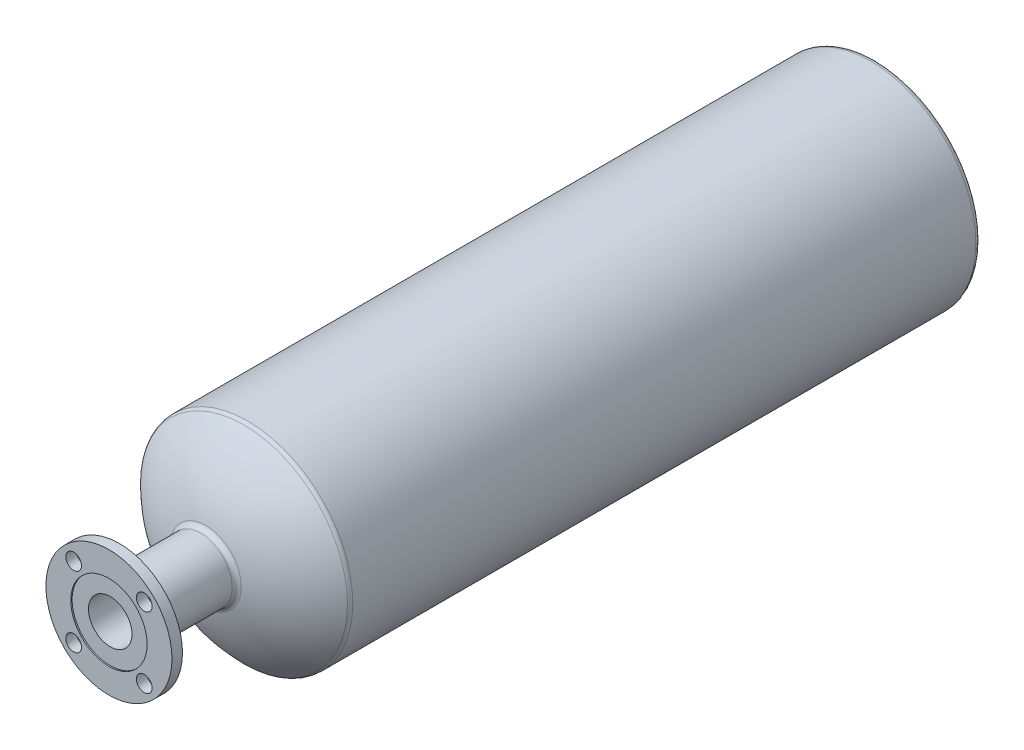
ISO-10303-21;
HEADER;
FILE_DESCRIPTION(('STEP AP214'),'2;1');
FILE_NAME('part.step','',(''),(''),'','','');
FILE_SCHEMA(('AUTOMOTIVE_DESIGN { 1 0 10303 214 1 1 1 1 }'));
ENDSEC;
DATA;
#1=APPLICATION_CONTEXT('core data for automotive mechanical design processes');
#2=APPLICATION_PROTOCOL_DEFINITION('international standard','automotive_design',2000,#1);
#3=PRODUCT_CONTEXT('',#1,'mechanical');
#4=PRODUCT('Part','Part','',(#3));
#5=PRODUCT_RELATED_PRODUCT_CATEGORY('part','',(#4));
#6=PRODUCT_DEFINITION_FORMATION('','',#4);
#7=PRODUCT_DEFINITION_CONTEXT('part definition',#1,'design');
#8=PRODUCT_DEFINITION('design','',#6,#7);
#9=PRODUCT_DEFINITION_SHAPE('','',#8);
#10=(LENGTH_UNIT() NAMED_UNIT(*) SI_UNIT(.MILLI.,.METRE.));
#11=(NAMED_UNIT(*) PLANE_ANGLE_UNIT() SI_UNIT($,.RADIAN.));
#12=(NAMED_UNIT(*) SI_UNIT($,.STERADIAN.) SOLID_ANGLE_UNIT());
#13=UNCERTAINTY_MEASURE_WITH_UNIT(LENGTH_MEASURE(1.E-05),#10,'distance_accuracy_value','');
#14=(GEOMETRIC_REPRESENTATION_CONTEXT(3) GLOBAL_UNCERTAINTY_ASSIGNED_CONTEXT((#13)) GLOBAL_UNIT_ASSIGNED_CONTEXT((#10,
#11,#12)) REPRESENTATION_CONTEXT('',''));
#15=CARTESIAN_POINT('',(0.,0.,0.));
#16=DIRECTION('',(0.,0.,1.));
#17=DIRECTION('',(1.,0.,0.));
#18=AXIS2_PLACEMENT_3D('',#15,#16,#17);
#19=CARTESIAN_POINT('',(0.,0.,-152.4));
#20=DIRECTION('',(0.,0.,1.));
#21=DIRECTION('',(1.,0.,0.));
#22=AXIS2_PLACEMENT_3D('',#19,#20,#21);
#23=CYLINDRICAL_SURFACE('',#22,38.1);
#24=CARTESIAN_POINT('',(0.,0.,-98.1292384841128));
#25=DIRECTION('',(0.,0.,-1.));
#26=DIRECTION('',(-1.,0.,0.));
#27=AXIS2_PLACEMENT_3D('',#24,#25,#26);
#28=CIRCLE('',#27,38.1);
#29=CARTESIAN_POINT('',(38.1,0.,-98.1292384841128));
#30=VERTEX_POINT('',#29);
#31=EDGE_CURVE('E40',#30,#30,#28,.F.);
#32=CARTESIAN_POINT('',(0.,0.,-6.34999999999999));
#33=DIRECTION('',(0.,0.,1.));
#34=DIRECTION('',(1.,0.,0.));
#35=AXIS2_PLACEMENT_3D('',#32,#33,#34);
#36=CIRCLE('',#35,38.1);
#37=CARTESIAN_POINT('',(38.1,0.,-6.35000000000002));
#38=VERTEX_POINT('',#37);
#39=EDGE_CURVE('E44',#38,#38,#36,.F.);
#40=CARTESIAN_POINT('',(38.1,0.,-98.1292384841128));
#41=CARTESIAN_POINT('',(38.1,0.,-97.1732047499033));
#42=CARTESIAN_POINT('',(38.1,0.,-96.2171710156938));
#43=CARTESIAN_POINT('',(38.1,0.,-94.3051035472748));
#44=CARTESIAN_POINT('',(38.1,0.,-93.3490698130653));
#45=CARTESIAN_POINT('',(38.1,0.,-91.4370023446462));
#46=CARTESIAN_POINT('',(38.1,0.,-90.4809686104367));
#47=CARTESIAN_POINT('',(38.1,0.,-88.5689011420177));
#48=CARTESIAN_POINT('',(38.1,0.,-87.6128674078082));
#49=CARTESIAN_POINT('',(38.1,0.,-85.7007999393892));
#50=CARTESIAN_POINT('',(38.1,0.,-84.7447662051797));
#51=CARTESIAN_POINT('',(38.1,0.,-82.8326987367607));
#52=CARTESIAN_POINT('',(38.1,0.,-81.8766650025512));
#53=CARTESIAN_POINT('',(38.1,0.,-79.9645975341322));
#54=CARTESIAN_POINT('',(38.1,0.,-79.0085637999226));
#55=CARTESIAN_POINT('',(38.1,0.,-77.0964963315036));
#56=CARTESIAN_POINT('',(38.1,0.,-76.1404625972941));
#57=CARTESIAN_POINT('',(38.1,0.,-74.2283951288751));
#58=CARTESIAN_POINT('',(38.1,0.,-73.2723613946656));
#59=CARTESIAN_POINT('',(38.1,0.,-71.3602939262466));
#60=CARTESIAN_POINT('',(38.1,0.,-70.4042601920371));
#61=CARTESIAN_POINT('',(38.1,0.,-68.4921927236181));
#62=CARTESIAN_POINT('',(38.1,0.,-67.5361589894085));
#63=CARTESIAN_POINT('',(38.1,0.,-65.6240915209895));
#64=CARTESIAN_POINT('',(38.1,0.,-64.66805778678));
#65=CARTESIAN_POINT('',(38.1,0.,-62.755990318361));
#66=CARTESIAN_POINT('',(38.1,0.,-61.7999565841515));
#67=CARTESIAN_POINT('',(38.1,0.,-59.8878891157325));
#68=CARTESIAN_POINT('',(38.1,0.,-58.931855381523));
#69=CARTESIAN_POINT('',(38.1,0.,-57.019787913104));
#70=CARTESIAN_POINT('',(38.1,0.,-56.0637541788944));
#71=CARTESIAN_POINT('',(38.1,0.,-54.1516867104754));
#72=CARTESIAN_POINT('',(38.1,0.,-53.1956529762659));
#73=CARTESIAN_POINT('',(38.1,0.,-51.2835855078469));
#74=CARTESIAN_POINT('',(38.1,0.,-50.3275517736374));
#75=CARTESIAN_POINT('',(38.1,0.,-48.4154843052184));
#76=CARTESIAN_POINT('',(38.1,0.,-47.4594505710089));
#77=CARTESIAN_POINT('',(38.1,0.,-45.5473831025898));
#78=CARTESIAN_POINT('',(38.1,0.,-44.5913493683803));
#79=CARTESIAN_POINT('',(38.1,0.,-42.6792818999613));
#80=CARTESIAN_POINT('',(38.1,0.,-41.7232481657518));
#81=CARTESIAN_POINT('',(38.1,0.,-39.8111806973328));
#82=CARTESIAN_POINT('',(38.1,0.,-38.8551469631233));
#83=CARTESIAN_POINT('',(38.1,0.,-36.9430794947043));
#84=CARTESIAN_POINT('',(38.1,0.,-35.9870457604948));
#85=CARTESIAN_POINT('',(38.1,0.,-34.0749782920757));
#86=CARTESIAN_POINT('',(38.1,0.,-33.1189445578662));
#87=CARTESIAN_POINT('',(38.1,0.,-31.2068770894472));
#88=CARTESIAN_POINT('',(38.1,0.,-30.2508433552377));
#89=CARTESIAN_POINT('',(38.1,0.,-28.3387758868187));
#90=CARTESIAN_POINT('',(38.1,0.,-27.3827421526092));
#91=CARTESIAN_POINT('',(38.1,0.,-25.4706746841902));
#92=CARTESIAN_POINT('',(38.1,0.,-24.5146409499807));
#93=CARTESIAN_POINT('',(38.1,0.,-22.6025734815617));
#94=CARTESIAN_POINT('',(38.1,0.,-21.6465397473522));
#95=CARTESIAN_POINT('',(38.1,0.,-19.7344722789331));
#96=CARTESIAN_POINT('',(38.1,0.,-18.7784385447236));
#97=CARTESIAN_POINT('',(38.1,0.,-16.8663710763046));
#98=CARTESIAN_POINT('',(38.1,0.,-15.9103373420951));
#99=CARTESIAN_POINT('',(38.1,0.,-13.9982698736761));
#100=CARTESIAN_POINT('',(38.1,0.,-13.0422361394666));
#101=CARTESIAN_POINT('',(38.1,0.,-11.1301686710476));
#102=CARTESIAN_POINT('',(38.1,0.,-10.1741349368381));
#103=CARTESIAN_POINT('',(38.1,0.,-8.26206746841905));
#104=CARTESIAN_POINT('',(38.1,0.,-7.30603373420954));
#105=CARTESIAN_POINT('',(38.1,0.,-6.35000000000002));
#106=B_SPLINE_CURVE_WITH_KNOTS('',3,(#40,#41,#42,#43,#44,#45,#46,#47,#48,#49,#50,#51,#52,#53,
#54,#55,#56,#57,#58,#59,#60,#61,#62,#63,#64,#65,#66,#67,#68,#69,#70,#71,#72,#73,#74,#75,#76,#77,
#78,#79,#80,#81,#82,#83,#84,#85,#86,#87,#88,#89,#90,#91,#92,#93,#94,#95,#96,#97,#98,#99,#100,
#101,#102,#103,#104,#105),.UNSPECIFIED.,.F.,.F.,(4,2,2,2,2,2,2,2,2,2,2,2,2,2,2,2,2,2,2,2,2,2,2,
2,2,2,2,2,2,2,2,2,4),(0.,2.86810120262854,5.73620240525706,8.60430360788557,11.4724048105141,
14.3405060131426,17.2086072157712,20.0767084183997,22.9448096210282,25.8129108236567,
28.6810120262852,31.5491132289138,34.4172144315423,37.2853156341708,40.1534168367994,
43.0215180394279,45.8896192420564,48.7577204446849,51.6258216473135,54.493922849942,
57.3620240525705,60.230125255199,63.0982264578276,65.9663276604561,68.8344288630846,
71.7025300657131,74.5706312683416,77.4387324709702,80.3068336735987,83.1749348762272,
86.0430360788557,88.9111372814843,91.7792384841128),.UNSPECIFIED.);
#107=EDGE_CURVE('BSEAM32',#30,#38,#106,.T.);
#108=ORIENTED_EDGE('',*,*,#31,.T.);
#109=ORIENTED_EDGE('',*,*,#39,.T.);
#110=ORIENTED_EDGE('',*,*,#107,.T.);
#111=ORIENTED_EDGE('',*,*,#107,.F.);
#112=EDGE_LOOP('',(#108,#110,#109,#111));
#113=FACE_BOUND('',#112,.T.);
#114=ADVANCED_FACE('F32',(#113),#23,.T.);
#115=CARTESIAN_POINT('',(0.,0.,0.));
#116=DIRECTION('',(0.,0.,1.));
#117=DIRECTION('',(1.,0.,0.));
#118=AXIS2_PLACEMENT_3D('',#115,#116,#117);
#119=PLANE('',#118);
#120=CARTESIAN_POINT('',(0.,0.,0.));
#121=DIRECTION('',(0.,0.,1.));
#122=DIRECTION('',(1.,0.,0.));
#123=AXIS2_PLACEMENT_3D('',#120,#121,#122);
#124=CIRCLE('',#123,44.45);
#125=CARTESIAN_POINT('',(44.45,0.,0.));
#126=VERTEX_POINT('',#125);
#127=EDGE_CURVE('E10',#126,#126,#124,.T.);
#128=ORIENTED_EDGE('',*,*,#127,.T.);
#129=EDGE_LOOP('',(#128));
#130=FACE_BOUND('',#129,.T.);
#131=CARTESIAN_POINT('',(-42.6562165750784,42.6562165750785,0.));
#132=DIRECTION('',(0.,0.,1.));
#133=DIRECTION('',(0.,1.,0.));
#134=AXIS2_PLACEMENT_3D('',#131,#132,#133);
#135=CIRCLE('',#134,9.525);
#136=CARTESIAN_POINT('',(-42.6562165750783,52.1812165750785,0.));
#137=VERTEX_POINT('',#136);
#138=EDGE_CURVE('E88',#137,#137,#135,.T.);
#139=ORIENTED_EDGE('',*,*,#138,.T.);
#140=EDGE_LOOP('',(#139));
#141=FACE_BOUND('',#140,.T.);
#142=CARTESIAN_POINT('',(42.6562165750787,-42.6562165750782,0.));
#143=DIRECTION('',(0.,0.,1.));
#144=DIRECTION('',(0.,-1.,0.));
#145=AXIS2_PLACEMENT_3D('',#142,#143,#144);
#146=CIRCLE('',#145,9.525);
#147=CARTESIAN_POINT('',(42.6562165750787,-52.1812165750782,0.));
#148=VERTEX_POINT('',#147);
#149=EDGE_CURVE('E74',#148,#148,#146,.T.);
#150=ORIENTED_EDGE('',*,*,#149,.T.);
#151=EDGE_LOOP('',(#150));
#152=FACE_BOUND('',#151,.T.);
#153=CARTESIAN_POINT('',(0.,0.,0.));
#154=DIRECTION('',(0.,0.,1.));
#155=DIRECTION('',(1.,0.,0.));
#156=AXIS2_PLACEMENT_3D('',#153,#154,#155);
#157=CIRCLE('',#156,76.2);
#158=CARTESIAN_POINT('',(76.2,0.,0.));
#159=VERTEX_POINT('',#158);
#160=EDGE_CURVE('E65',#159,#159,#157,.T.);
#161=ORIENTED_EDGE('',*,*,#160,.F.);
#162=EDGE_LOOP('',(#161));
#163=FACE_BOUND('',#162,.T.);
#164=CARTESIAN_POINT('',(42.6562165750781,42.6562165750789,0.));
#165=DIRECTION('',(0.,0.,1.));
#166=DIRECTION('',(1.,0.,0.));
#167=AXIS2_PLACEMENT_3D('',#164,#165,#166);
#168=CIRCLE('',#167,9.525);
#169=CARTESIAN_POINT('',(52.1812165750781,42.6562165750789,0.));
#170=VERTEX_POINT('',#169);
#171=EDGE_CURVE('E71',#170,#170,#168,.T.);
#172=ORIENTED_EDGE('',*,*,#171,.T.);
#173=EDGE_LOOP('',(#172));
#174=FACE_BOUND('',#173,.T.);
#175=CARTESIAN_POINT('',(-42.6562165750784,-42.6562165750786,0.));
#176=DIRECTION('',(0.,0.,1.));
#177=DIRECTION('',(-1.,0.,0.));
#178=AXIS2_PLACEMENT_3D('',#175,#176,#177);
#179=CIRCLE('',#178,9.525);
#180=CARTESIAN_POINT('',(-52.1812165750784,-42.6562165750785,0.));
#181=VERTEX_POINT('',#180);
#182=EDGE_CURVE('E82',#181,#181,#179,.T.);
#183=ORIENTED_EDGE('',*,*,#182,.T.);
#184=EDGE_LOOP('',(#183));
#185=FACE_BOUND('',#184,.T.);
#186=ADVANCED_FACE('F123',(#130,#141,#152,#163,#174,#185),#119,.F.);
#187=CARTESIAN_POINT('',(0.,0.,12.7));
#188=DIRECTION('',(0.,0.,1.));
#189=DIRECTION('',(1.,0.,0.));
#190=AXIS2_PLACEMENT_3D('',#187,#188,#189);
#191=PLANE('',#190);
#192=CARTESIAN_POINT('',(0.,0.,12.7));
#193=DIRECTION('',(0.,0.,1.));
#194=DIRECTION('',(1.,0.,0.));
#195=AXIS2_PLACEMENT_3D('',#192,#193,#194);
#196=CIRCLE('',#195,46.101);
#197=CARTESIAN_POINT('',(46.101,0.,12.7));
#198=VERTEX_POINT('',#197);
#199=EDGE_CURVE('E97',#198,#198,#196,.T.);
#200=ORIENTED_EDGE('',*,*,#199,.F.);
#201=EDGE_LOOP('',(#200));
#202=FACE_BOUND('',#201,.T.);
#203=CARTESIAN_POINT('',(-42.6562165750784,-42.6562165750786,12.7));
#204=DIRECTION('',(0.,0.,1.));
#205=DIRECTION('',(-1.,0.,0.));
#206=AXIS2_PLACEMENT_3D('',#203,#204,#205);
#207=CIRCLE('',#206,9.525);
#208=CARTESIAN_POINT('',(-52.1812165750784,-42.6562165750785,12.7));
#209=VERTEX_POINT('',#208);
#210=EDGE_CURVE('E85',#209,#209,#207,.T.);
#211=ORIENTED_EDGE('',*,*,#210,.F.);
#212=EDGE_LOOP('',(#211));
#213=FACE_BOUND('',#212,.T.);
#214=CARTESIAN_POINT('',(42.6562165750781,42.6562165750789,12.7));
#215=DIRECTION('',(0.,0.,1.));
#216=DIRECTION('',(1.,0.,0.));
#217=AXIS2_PLACEMENT_3D('',#214,#215,#216);
#218=CIRCLE('',#217,9.525);
#219=CARTESIAN_POINT('',(52.1812165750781,42.6562165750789,12.7));
#220=VERTEX_POINT('',#219);
#221=EDGE_CURVE('E68',#220,#220,#218,.T.);
#222=ORIENTED_EDGE('',*,*,#221,.F.);
#223=EDGE_LOOP('',(#222));
#224=FACE_BOUND('',#223,.T.);
#225=CARTESIAN_POINT('',(0.,0.,12.7));
#226=DIRECTION('',(0.,0.,1.));
#227=DIRECTION('',(1.,0.,0.));
#228=AXIS2_PLACEMENT_3D('',#225,#226,#227);
#229=CIRCLE('',#228,76.2);
#230=CARTESIAN_POINT('',(76.2,0.,12.7));
#231=VERTEX_POINT('',#230);
#232=EDGE_CURVE('E64',#231,#231,#229,.T.);
#233=ORIENTED_EDGE('',*,*,#232,.T.);
#234=EDGE_LOOP('',(#233));
#235=FACE_BOUND('',#234,.T.);
#236=CARTESIAN_POINT('',(42.6562165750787,-42.6562165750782,12.7));
#237=DIRECTION('',(0.,0.,1.));
#238=DIRECTION('',(0.,-1.,0.));
#239=AXIS2_PLACEMENT_3D('',#236,#237,#238);
#240=CIRCLE('',#239,9.525);
#241=CARTESIAN_POINT('',(42.6562165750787,-52.1812165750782,12.7));
#242=VERTEX_POINT('',#241);
#243=EDGE_CURVE('E79',#242,#242,#240,.T.);
#244=ORIENTED_EDGE('',*,*,#243,.F.);
#245=EDGE_LOOP('',(#244));
#246=FACE_BOUND('',#245,.T.);
#247=CARTESIAN_POINT('',(-42.6562165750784,42.6562165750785,12.7));
#248=DIRECTION('',(0.,0.,1.));
#249=DIRECTION('',(0.,1.,0.));
#250=AXIS2_PLACEMENT_3D('',#247,#248,#249);
#251=CIRCLE('',#250,9.525);
#252=CARTESIAN_POINT('',(-42.6562165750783,52.1812165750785,12.7));
#253=VERTEX_POINT('',#252);
#254=EDGE_CURVE('E91',#253,#253,#251,.T.);
#255=ORIENTED_EDGE('',*,*,#254,.F.);
#256=EDGE_LOOP('',(#255));
#257=FACE_BOUND('',#256,.T.);
#258=ADVANCED_FACE('F129',(#202,#213,#224,#235,#246,#257),#191,.T.);
#259=CARTESIAN_POINT('',(0.,0.,12.7));
#260=DIRECTION('',(0.,0.,-1.));
#261=DIRECTION('',(-1.,0.,0.));
#262=AXIS2_PLACEMENT_3D('',#259,#260,#261);
#263=CYLINDRICAL_SURFACE('',#262,76.2);
#264=ORIENTED_EDGE('',*,*,#232,.F.);
#265=EDGE_LOOP('',(#264));
#266=FACE_BOUND('',#265,.T.);
#267=ORIENTED_EDGE('',*,*,#160,.T.);
#268=EDGE_LOOP('',(#267));
#269=FACE_BOUND('',#268,.T.);
#270=ADVANCED_FACE('F151',(#266,#269),#263,.T.);
#271=CARTESIAN_POINT('',(42.6562165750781,42.6562165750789,12.7));
#272=DIRECTION('',(0.,0.,-1.));
#273=DIRECTION('',(-1.,0.,0.));
#274=AXIS2_PLACEMENT_3D('',#271,#272,#273);
#275=CYLINDRICAL_SURFACE('',#274,9.525);
#276=ORIENTED_EDGE('',*,*,#221,.T.);
#277=EDGE_LOOP('',(#276));
#278=FACE_BOUND('',#277,.T.);
#279=ORIENTED_EDGE('',*,*,#171,.F.);
#280=EDGE_LOOP('',(#279));
#281=FACE_BOUND('',#280,.T.);
#282=ADVANCED_FACE('F147',(#278,#281),#275,.F.);
#283=CARTESIAN_POINT('',(42.6562165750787,-42.6562165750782,12.7));
#284=DIRECTION('',(0.,0.,-1.));
#285=DIRECTION('',(0.,1.,0.));
#286=AXIS2_PLACEMENT_3D('',#283,#284,#285);
#287=CYLINDRICAL_SURFACE('',#286,9.525);
#288=ORIENTED_EDGE('',*,*,#243,.T.);
#289=EDGE_LOOP('',(#288));
#290=FACE_BOUND('',#289,.T.);
#291=ORIENTED_EDGE('',*,*,#149,.F.);
#292=EDGE_LOOP('',(#291));
#293=FACE_BOUND('',#292,.T.);
#294=ADVANCED_FACE('F143',(#290,#293),#287,.F.);
#295=CARTESIAN_POINT('',(-42.6562165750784,-42.6562165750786,12.7));
#296=DIRECTION('',(0.,0.,-1.));
#297=DIRECTION('',(1.,0.,0.));
#298=AXIS2_PLACEMENT_3D('',#295,#296,#297);
#299=CYLINDRICAL_SURFACE('',#298,9.525);
#300=ORIENTED_EDGE('',*,*,#210,.T.);
#301=EDGE_LOOP('',(#300));
#302=FACE_BOUND('',#301,.T.);
#303=ORIENTED_EDGE('',*,*,#182,.F.);
#304=EDGE_LOOP('',(#303));
#305=FACE_BOUND('',#304,.T.);
#306=ADVANCED_FACE('F139',(#302,#305),#299,.F.);
#307=CARTESIAN_POINT('',(-42.6562165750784,42.6562165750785,12.7));
#308=DIRECTION('',(0.,0.,-1.));
#309=DIRECTION('',(0.,-1.,0.));
#310=AXIS2_PLACEMENT_3D('',#307,#308,#309);
#311=CYLINDRICAL_SURFACE('',#310,9.525);
#312=ORIENTED_EDGE('',*,*,#254,.T.);
#313=EDGE_LOOP('',(#312));
#314=FACE_BOUND('',#313,.T.);
#315=ORIENTED_EDGE('',*,*,#138,.F.);
#316=EDGE_LOOP('',(#315));
#317=FACE_BOUND('',#316,.T.);
#318=ADVANCED_FACE('F136',(#314,#317),#311,.F.);
#319=CARTESIAN_POINT('',(0.,0.,-276.834078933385));
#320=DIRECTION('',(0.,0.,1.));
#321=DIRECTION('',(0.,1.,0.));
#322=AXIS2_PLACEMENT_3D('',#319,#320,#321);
#323=SPHERICAL_SURFACE('',#322,177.8);
#324=CARTESIAN_POINT('',(0.,0.,-150.508324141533));
#325=DIRECTION('',(0.,0.,-1.));
#326=DIRECTION('',(-1.,0.,0.));
#327=AXIS2_PLACEMENT_3D('',#324,#325,#326);
#328=CIRCLE('',#327,125.118518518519);
#329=CARTESIAN_POINT('',(0.,125.118518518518,-150.508324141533));
#330=VERTEX_POINT('',#329);
#331=EDGE_CURVE('E49',#330,#330,#328,.F.);
#332=CARTESIAN_POINT('',(0.,0.,-104.291474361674));
#333=DIRECTION('',(0.,0.,-1.));
#334=DIRECTION('',(-1.,0.,0.));
#335=AXIS2_PLACEMENT_3D('',#332,#333,#334);
#336=CIRCLE('',#335,42.9172413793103);
#337=CARTESIAN_POINT('',(0.,42.9172413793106,-104.291474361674));
#338=VERTEX_POINT('',#337);
#339=EDGE_CURVE('E52',#338,#338,#336,.T.);
#340=CARTESIAN_POINT('',(0.,125.118518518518,-150.508324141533));
#341=CARTESIAN_POINT('',(0.,124.41213435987,-149.808689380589));
#342=CARTESIAN_POINT('',(0.,123.699880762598,-149.114980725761));
#343=CARTESIAN_POINT('',(0.,122.263837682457,-147.739608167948));
#344=CARTESIAN_POINT('',(0.,121.540048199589,-147.057944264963));
#345=CARTESIAN_POINT('',(0.,120.08113633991,-145.706853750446));
#346=CARTESIAN_POINT('',(0.,119.346013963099,-145.037427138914));
#347=CARTESIAN_POINT('',(0.,117.864643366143,-143.710999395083));
#348=CARTESIAN_POINT('',(0.,117.118395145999,-143.053998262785));
#349=CARTESIAN_POINT('',(0.,115.614982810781,-141.752606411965));
#350=CARTESIAN_POINT('',(0.,114.857818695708,-141.108215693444));
#351=CARTESIAN_POINT('',(0.,113.332787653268,-139.832225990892));
#352=CARTESIAN_POINT('',(0.,112.564920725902,-139.200627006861));
#353=CARTESIAN_POINT('',(0.,111.018700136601,-137.950398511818));
#354=CARTESIAN_POINT('',(0.,110.240346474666,-137.331769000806));
#355=CARTESIAN_POINT('',(0.,108.67337144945,-136.107653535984));
#356=CARTESIAN_POINT('',(0.,107.884750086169,-135.502167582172));
#357=CARTESIAN_POINT('',(0.,106.297461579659,-134.304509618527));
#358=CARTESIAN_POINT('',(0.,105.49879443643,-133.712337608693));
#359=CARTESIAN_POINT('',(0.,103.891639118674,-132.541474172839));
#360=CARTESIAN_POINT('',(0.,103.083150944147,-131.962782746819));
#361=CARTESIAN_POINT('',(0.,101.456581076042,-130.819043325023));
#362=CARTESIAN_POINT('',(0.,100.638499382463,-130.253995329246));
#363=CARTESIAN_POINT('',(0.,98.992972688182,-129.137701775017));
#364=CARTESIAN_POINT('',(0.,98.1655276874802,-128.586456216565));
#365=CARTESIAN_POINT('',(0.,96.5015072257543,-127.497922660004));
#366=CARTESIAN_POINT('',(0.,95.6649317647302,-126.960634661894));
#367=CARTESIAN_POINT('',(0.,93.982885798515,-125.900167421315));
#368=CARTESIAN_POINT('',(0.,93.1374152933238,-125.376988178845));
#369=CARTESIAN_POINT('',(0.,91.4378171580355,-124.344885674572));
#370=CARTESIAN_POINT('',(0.,90.5836895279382,-123.835962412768));
#371=CARTESIAN_POINT('',(0.,88.8670174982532,-122.832515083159));
#372=CARTESIAN_POINT('',(0.,88.0044730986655,-122.337991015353));
#373=CARTESIAN_POINT('',(0.,86.2712102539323,-121.363481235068));
#374=CARTESIAN_POINT('',(0.,85.4004918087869,-120.88349552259));
#375=CARTESIAN_POINT('',(0.,83.651125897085,-119.938197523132));
#376=CARTESIAN_POINT('',(0.,82.7724784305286,-119.472885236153));
#377=CARTESIAN_POINT('',(0.,81.0075017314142,-118.557065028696));
#378=CARTESIAN_POINT('',(0.,80.1211724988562,-118.106557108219));
#379=CARTESIAN_POINT('',(0.,78.3410816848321,-117.220472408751));
#380=CARTESIAN_POINT('',(0.,77.4473201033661,-116.784895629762));
#381=CARTESIAN_POINT('',(0.,75.6526161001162,-115.928795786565));
#382=CARTESIAN_POINT('',(0.,74.7516736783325,-115.508272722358));
#383=CARTESIAN_POINT('',(0.,72.9428615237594,-114.682398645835));
#384=CARTESIAN_POINT('',(0.,72.03499179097,-114.277047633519));
#385=CARTESIAN_POINT('',(0.,70.2125804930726,-113.481631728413));
#386=CARTESIAN_POINT('',(0.,69.2980389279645,-113.091566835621));
#387=CARTESIAN_POINT('',(0.,67.462541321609,-112.32683293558));
#388=CARTESIAN_POINT('',(0.,66.5415852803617,-111.95216392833));
#389=CARTESIAN_POINT('',(0.,64.6935178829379,-111.218327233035));
#390=CARTESIAN_POINT('',(0.,63.7664065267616,-110.85915954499));
#391=CARTESIAN_POINT('',(0.,61.9062893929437,-110.156426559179));
#392=CARTESIAN_POINT('',(0.,60.9732836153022,-109.812861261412));
#393=CARTESIAN_POINT('',(0.,59.1016401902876,-109.141429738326));
#394=CARTESIAN_POINT('',(0.,58.1630025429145,-108.813563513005));
#395=CARTESIAN_POINT('',(0.,56.2803595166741,-108.173622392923));
#396=CARTESIAN_POINT('',(0.,55.3363541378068,-107.861547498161));
#397=CARTESIAN_POINT('',(0.,53.4432412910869,-107.253276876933));
#398=CARTESIAN_POINT('',(0.,52.4941338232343,-106.957081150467));
#399=CARTESIAN_POINT('',(0.,50.5910839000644,-106.380652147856));
#400=CARTESIAN_POINT('',(0.,49.637141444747,-106.100418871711));
#401=CARTESIAN_POINT('',(0.,47.7246899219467,-105.555993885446));
#402=CARTESIAN_POINT('',(0.,46.7661808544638,-105.291802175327));
#403=CARTESIAN_POINT('',(0.,44.8448660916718,-104.779533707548));
#404=CARTESIAN_POINT('',(0.,43.8820603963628,-104.531456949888));
#405=CARTESIAN_POINT('',(0.,42.9172413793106,-104.291474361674));
#406=B_SPLINE_CURVE_WITH_KNOTS('',3,(#340,#341,#342,#343,#344,#345,#346,#347,#348,#349,#350,
#351,#352,#353,#354,#355,#356,#357,#358,#359,#360,#361,#362,#363,#364,#365,#366,#367,#368,#369,
#370,#371,#372,#373,#374,#375,#376,#377,#378,#379,#380,#381,#382,#383,#384,#385,#386,#387,#388,
#389,#390,#391,#392,#393,#394,#395,#396,#397,#398,#399,#400,#401,#402,#403,#404,#405),
.UNSPECIFIED.,.F.,.F.,(4,2,2,2,2,2,2,2,2,2,2,2,2,2,2,2,2,2,2,2,2,2,2,2,2,2,2,2,2,2,2,2,4),(0.,
2.98261588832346,5.96523177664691,8.94784766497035,11.9304635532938,14.9130794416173,
17.8956953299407,20.8783112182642,23.8609271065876,26.8435429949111,29.8261588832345,
32.808774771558,35.7913906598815,38.7740065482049,41.7566224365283,44.7392383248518,
47.7218542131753,50.7044701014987,53.6870859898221,56.6697018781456,59.6523177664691,
62.6349336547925,65.617549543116,68.6001654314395,71.5827813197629,74.5653972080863,
77.5480130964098,80.5306289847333,83.5132448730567,86.4958607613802,89.4784766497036,
92.461092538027,95.4437084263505),.UNSPECIFIED.);
#407=EDGE_CURVE('BSEAM134',#330,#338,#406,.T.);
#408=ORIENTED_EDGE('',*,*,#331,.T.);
#409=ORIENTED_EDGE('',*,*,#339,.T.);
#410=ORIENTED_EDGE('',*,*,#407,.T.);
#411=ORIENTED_EDGE('',*,*,#407,.F.);
#412=EDGE_LOOP('',(#408,#410,#409,#411));
#413=FACE_BOUND('',#412,.T.);
#414=ADVANCED_FACE('F134',(#413),#323,.T.);
#415=CARTESIAN_POINT('',(0.,0.,-152.4));
#416=DIRECTION('',(0.,0.,1.));
#417=DIRECTION('',(1.,0.,0.));
#418=AXIS2_PLACEMENT_3D('',#415,#416,#417);
#419=CYLINDRICAL_SURFACE('',#418,127.);
#420=CARTESIAN_POINT('',(0.,0.,-908.05));
#421=DIRECTION('',(0.,0.,1.));
#422=DIRECTION('',(1.,0.,0.));
#423=AXIS2_PLACEMENT_3D('',#420,#421,#422);
#424=CIRCLE('',#423,127.);
#425=CARTESIAN_POINT('',(127.,0.,-908.05));
#426=VERTEX_POINT('',#425);
#427=EDGE_CURVE('E58',#426,#426,#424,.T.);
#428=ORIENTED_EDGE('',*,*,#427,.T.);
#429=EDGE_LOOP('',(#428));
#430=FACE_BOUND('',#429,.T.);
#431=CARTESIAN_POINT('',(0.,0.,-155.019958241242));
#432=DIRECTION('',(0.,0.,-1.));
#433=DIRECTION('',(-1.,0.,0.));
#434=AXIS2_PLACEMENT_3D('',#431,#432,#433);
#435=CIRCLE('',#434,127.);
#436=CARTESIAN_POINT('',(-127.,0.,-155.019958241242));
#437=VERTEX_POINT('',#436);
#438=EDGE_CURVE('E61',#437,#437,#435,.T.);
#439=ORIENTED_EDGE('',*,*,#438,.T.);
#440=EDGE_LOOP('',(#439));
#441=FACE_BOUND('',#440,.T.);
#442=ADVANCED_FACE('F179',(#430,#441),#419,.T.);
#443=CARTESIAN_POINT('',(0.,127.,-914.4));
#444=DIRECTION('',(0.,0.,1.));
#445=DIRECTION('',(1.,0.,0.));
#446=AXIS2_PLACEMENT_3D('',#443,#444,#445);
#447=PLANE('',#446);
#448=CARTESIAN_POINT('',(0.,0.,-914.4));
#449=DIRECTION('',(0.,0.,1.));
#450=DIRECTION('',(1.,0.,0.));
#451=AXIS2_PLACEMENT_3D('',#448,#449,#450);
#452=CIRCLE('',#451,120.65);
#453=CARTESIAN_POINT('',(120.65,0.,-914.4));
#454=VERTEX_POINT('',#453);
#455=EDGE_CURVE('E55',#454,#454,#452,.F.);
#456=ORIENTED_EDGE('',*,*,#455,.T.);
#457=EDGE_LOOP('',(#456));
#458=FACE_BOUND('',#457,.T.);
#459=ADVANCED_FACE('F163',(#458),#447,.F.);
#460=CARTESIAN_POINT('',(0.,0.,-908.05));
#461=DIRECTION('',(0.,0.,1.));
#462=DIRECTION('',(1.,0.,0.));
#463=AXIS2_PLACEMENT_3D('',#460,#461,#462);
#464=TOROIDAL_SURFACE('',#463,120.65,6.35);
#465=ORIENTED_EDGE('',*,*,#455,.F.);
#466=EDGE_LOOP('',(#465));
#467=FACE_BOUND('',#466,.T.);
#468=ORIENTED_EDGE('',*,*,#427,.F.);
#469=EDGE_LOOP('',(#468));
#470=FACE_BOUND('',#469,.T.);
#471=ADVANCED_FACE('F159',(#467,#470),#464,.T.);
#472=CARTESIAN_POINT('',(0.,0.,-155.019958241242));
#473=DIRECTION('',(0.,0.,-1.));
#474=DIRECTION('',(-1.,0.,0.));
#475=AXIS2_PLACEMENT_3D('',#472,#473,#474);
#476=TOROIDAL_SURFACE('',#475,120.65,6.35);
#477=ORIENTED_EDGE('',*,*,#438,.F.);
#478=EDGE_LOOP('',(#477));
#479=FACE_BOUND('',#478,.T.);
#480=ORIENTED_EDGE('',*,*,#331,.F.);
#481=EDGE_LOOP('',(#480));
#482=FACE_BOUND('',#481,.T.);
#483=ADVANCED_FACE('F162',(#479,#482),#476,.T.);
#484=CARTESIAN_POINT('',(0.,0.,-98.1292384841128));
#485=DIRECTION('',(0.,0.,-1.));
#486=DIRECTION('',(-1.,0.,0.));
#487=AXIS2_PLACEMENT_3D('',#484,#485,#486);
#488=TOROIDAL_SURFACE('',#487,44.45,6.35);
#489=ORIENTED_EDGE('',*,*,#31,.F.);
#490=EDGE_LOOP('',(#489));
#491=FACE_BOUND('',#490,.T.);
#492=ORIENTED_EDGE('',*,*,#339,.F.);
#493=EDGE_LOOP('',(#492));
#494=FACE_BOUND('',#493,.T.);
#495=ADVANCED_FACE('F166',(#491,#494),#488,.F.);
#496=CARTESIAN_POINT('',(0.,0.,-6.34999999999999));
#497=DIRECTION('',(0.,0.,1.));
#498=DIRECTION('',(1.,0.,0.));
#499=AXIS2_PLACEMENT_3D('',#496,#497,#498);
#500=TOROIDAL_SURFACE('',#499,44.45,6.35);
#501=ORIENTED_EDGE('',*,*,#127,.F.);
#502=EDGE_LOOP('',(#501));
#503=FACE_BOUND('',#502,.T.);
#504=ORIENTED_EDGE('',*,*,#39,.F.);
#505=EDGE_LOOP('',(#504));
#506=FACE_BOUND('',#505,.T.);
#507=ADVANCED_FACE('F34',(#503,#506),#500,.F.);
#508=CARTESIAN_POINT('',(0.,0.,11.1125));
#509=DIRECTION('',(0.,0.,1.));
#510=DIRECTION('',(1.,0.,0.));
#511=AXIS2_PLACEMENT_3D('',#508,#509,#510);
#512=PLANE('',#511);
#513=CARTESIAN_POINT('',(0.,0.,11.1125));
#514=DIRECTION('',(0.,0.,1.));
#515=DIRECTION('',(1.,0.,0.));
#516=AXIS2_PLACEMENT_3D('',#513,#514,#515);
#517=CIRCLE('',#516,46.101);
#518=CARTESIAN_POINT('',(46.101,0.,11.1125));
#519=VERTEX_POINT('',#518);
#520=EDGE_CURVE('E100',#519,#519,#517,.T.);
#521=ORIENTED_EDGE('',*,*,#520,.T.);
#522=EDGE_LOOP('',(#521));
#523=FACE_BOUND('',#522,.T.);
#524=CARTESIAN_POINT('',(0.,0.,11.1125));
#525=DIRECTION('',(0.,0.,1.));
#526=DIRECTION('',(1.,0.,0.));
#527=AXIS2_PLACEMENT_3D('',#524,#525,#526);
#528=CIRCLE('',#527,26.289);
#529=CARTESIAN_POINT('',(26.289,0.,11.1125));
#530=VERTEX_POINT('',#529);
#531=EDGE_CURVE('E36',#530,#530,#528,.F.);
#532=ORIENTED_EDGE('',*,*,#531,.T.);
#533=EDGE_LOOP('',(#532));
#534=FACE_BOUND('',#533,.T.);
#535=ADVANCED_FACE('F107',(#523,#534),#512,.T.);
#536=CARTESIAN_POINT('',(0.,0.,11.1125));
#537=DIRECTION('',(0.,0.,1.));
#538=DIRECTION('',(1.,0.,0.));
#539=AXIS2_PLACEMENT_3D('',#536,#537,#538);
#540=CYLINDRICAL_SURFACE('',#539,46.101);
#541=ORIENTED_EDGE('',*,*,#520,.F.);
#542=EDGE_LOOP('',(#541));
#543=FACE_BOUND('',#542,.T.);
#544=ORIENTED_EDGE('',*,*,#199,.T.);
#545=EDGE_LOOP('',(#544));
#546=FACE_BOUND('',#545,.T.);
#547=ADVANCED_FACE('F117',(#543,#546),#540,.F.);
#548=CARTESIAN_POINT('',(0.,0.,-114.3));
#549=DIRECTION('',(0.,0.,1.));
#550=DIRECTION('',(1.,0.,0.));
#551=AXIS2_PLACEMENT_3D('',#548,#549,#550);
#552=PLANE('',#551);
#553=CARTESIAN_POINT('',(0.,0.,-114.3));
#554=DIRECTION('',(0.,0.,1.));
#555=DIRECTION('',(1.,0.,0.));
#556=AXIS2_PLACEMENT_3D('',#553,#554,#555);
#557=CIRCLE('',#556,26.289);
#558=CARTESIAN_POINT('',(26.289,0.,-114.3));
#559=VERTEX_POINT('',#558);
#560=EDGE_CURVE('E94',#559,#559,#557,.T.);
#561=ORIENTED_EDGE('',*,*,#560,.T.);
#562=EDGE_LOOP('',(#561));
#563=FACE_BOUND('',#562,.T.);
#564=ADVANCED_FACE('F111',(#563),#552,.T.);
#565=CARTESIAN_POINT('',(0.,0.,-114.3));
#566=DIRECTION('',(0.,0.,1.));
#567=DIRECTION('',(1.,0.,0.));
#568=AXIS2_PLACEMENT_3D('',#565,#566,#567);
#569=CYLINDRICAL_SURFACE('',#568,26.289);
#570=ORIENTED_EDGE('',*,*,#560,.F.);
#571=EDGE_LOOP('',(#570));
#572=FACE_BOUND('',#571,.T.);
#573=ORIENTED_EDGE('',*,*,#531,.F.);
#574=EDGE_LOOP('',(#573));
#575=FACE_BOUND('',#574,.T.);
#576=ADVANCED_FACE('F109',(#572,#575),#569,.F.);
#577=CLOSED_SHELL('',(#114,#186,#258,#270,#282,#294,#306,#318,#414,#442,#459,#471,#483,#495,
#507,#535,#547,#564,#576));
#578=MANIFOLD_SOLID_BREP('B2',#577);
#579=ADVANCED_BREP_SHAPE_REPRESENTATION('',(#18,#578),#14);
#580=SHAPE_DEFINITION_REPRESENTATION(#9,#579);
ENDSEC;
END-ISO-10303-21;
